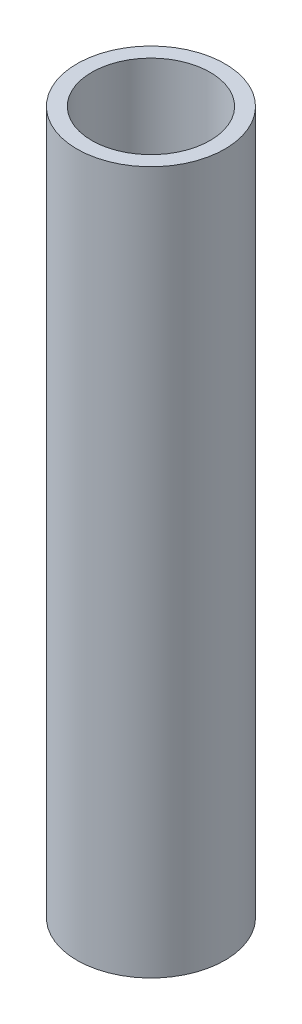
from build123d import *

# Parameters (mm, degrees)
SKETCH1_R           = 10
SKETCH1_R_2         = 8
BOSS_EXTRUDE1_DEPTH = 95


with BuildPart() as part:
    # Sketch1 → Boss-Extrude1 (new body)
    with BuildSketch(Plane(origin=(0, 0, 0), x_dir=(1, 0, 0), z_dir=(0, 1, 0))):
        with Locations(Location((0, 0, 0), (0, 0, 270))):
            Circle(SKETCH1_R)
        with Locations(Location((0, 0, 0), (0, 0, 270))):
            Circle(SKETCH1_R_2, mode=Mode.SUBTRACT)
    extrude(amount=BOSS_EXTRUDE1_DEPTH)


solid = part.part
